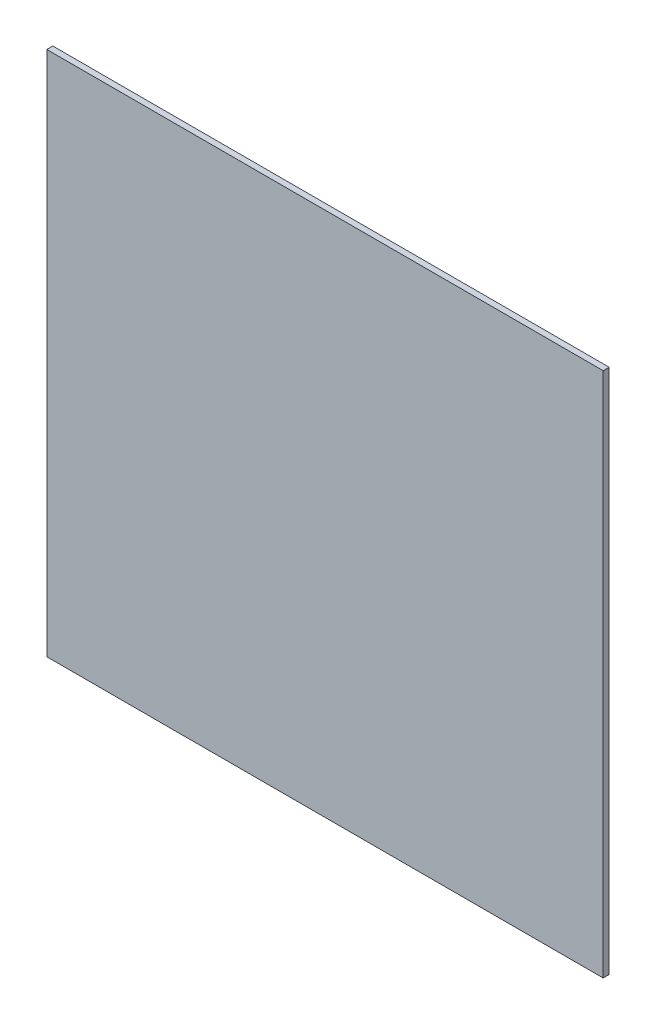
ISO-10303-21;
HEADER;
FILE_DESCRIPTION(('STEP AP214'),'2;1');
FILE_NAME('part.step','',(''),(''),'','','');
FILE_SCHEMA(('AUTOMOTIVE_DESIGN { 1 0 10303 214 1 1 1 1 }'));
ENDSEC;
DATA;
#1=APPLICATION_CONTEXT('core data for automotive mechanical design processes');
#2=APPLICATION_PROTOCOL_DEFINITION('international standard','automotive_design',2000,#1);
#3=PRODUCT_CONTEXT('',#1,'mechanical');
#4=PRODUCT('Part','Part','',(#3));
#5=PRODUCT_RELATED_PRODUCT_CATEGORY('part','',(#4));
#6=PRODUCT_DEFINITION_FORMATION('','',#4);
#7=PRODUCT_DEFINITION_CONTEXT('part definition',#1,'design');
#8=PRODUCT_DEFINITION('design','',#6,#7);
#9=PRODUCT_DEFINITION_SHAPE('','',#8);
#10=(LENGTH_UNIT() NAMED_UNIT(*) SI_UNIT(.MILLI.,.METRE.));
#11=(NAMED_UNIT(*) PLANE_ANGLE_UNIT() SI_UNIT($,.RADIAN.));
#12=(NAMED_UNIT(*) SI_UNIT($,.STERADIAN.) SOLID_ANGLE_UNIT());
#13=UNCERTAINTY_MEASURE_WITH_UNIT(LENGTH_MEASURE(1.E-05),#10,'distance_accuracy_value','');
#14=(GEOMETRIC_REPRESENTATION_CONTEXT(3) GLOBAL_UNCERTAINTY_ASSIGNED_CONTEXT((#13)) GLOBAL_UNIT_ASSIGNED_CONTEXT((#10,
#11,#12)) REPRESENTATION_CONTEXT('',''));
#15=CARTESIAN_POINT('',(0.,0.,0.));
#16=DIRECTION('',(0.,0.,1.));
#17=DIRECTION('',(1.,0.,0.));
#18=AXIS2_PLACEMENT_3D('',#15,#16,#17);
#19=CARTESIAN_POINT('',(-1515.5,1965.,8.));
#20=DIRECTION('',(1.,0.,0.));
#21=DIRECTION('',(0.,1.,0.));
#22=AXIS2_PLACEMENT_3D('',#19,#20,#21);
#23=PLANE('',#22);
#24=DIRECTION('',(0.,-1.,0.));
#25=VECTOR('',#24,1.);
#26=CARTESIAN_POINT('',(-1515.5,1965.,-8.));
#27=LINE('',#26,#25);
#28=CARTESIAN_POINT('',(-1515.5,1965.,-8.));
#29=VERTEX_POINT('',#28);
#30=CARTESIAN_POINT('',(-1515.5,565.,-8.));
#31=VERTEX_POINT('',#30);
#32=EDGE_CURVE('E93',#29,#31,#27,.T.);
#33=ORIENTED_EDGE('',*,*,#32,.T.);
#34=DIRECTION('',(0.,0.,-1.));
#35=VECTOR('',#34,1.);
#36=CARTESIAN_POINT('',(-1515.5,565.,8.));
#37=LINE('',#36,#35);
#38=CARTESIAN_POINT('',(-1515.5,565.,8.));
#39=VERTEX_POINT('',#38);
#40=EDGE_CURVE('E11',#39,#31,#37,.T.);
#41=ORIENTED_EDGE('',*,*,#40,.F.);
#42=DIRECTION('',(0.,-1.,0.));
#43=VECTOR('',#42,1.);
#44=CARTESIAN_POINT('',(-1515.5,1965.,8.));
#45=LINE('',#44,#43);
#46=CARTESIAN_POINT('',(-1515.5,1965.,8.));
#47=VERTEX_POINT('',#46);
#48=EDGE_CURVE('E81',#47,#39,#45,.T.);
#49=ORIENTED_EDGE('',*,*,#48,.F.);
#50=DIRECTION('',(0.,0.,-1.));
#51=VECTOR('',#50,1.);
#52=CARTESIAN_POINT('',(-1515.5,1965.,8.));
#53=LINE('',#52,#51);
#54=EDGE_CURVE('E89',#47,#29,#53,.T.);
#55=ORIENTED_EDGE('',*,*,#54,.T.);
#56=EDGE_LOOP('',(#33,#41,#49,#55));
#57=FACE_BOUND('',#56,.T.);
#58=ADVANCED_FACE('F30',(#57),#23,.F.);
#59=CARTESIAN_POINT('',(-1515.5,565.,8.));
#60=DIRECTION('',(0.,1.,0.));
#61=DIRECTION('',(0.,0.,1.));
#62=AXIS2_PLACEMENT_3D('',#59,#60,#61);
#63=PLANE('',#62);
#64=DIRECTION('',(1.,0.,0.));
#65=VECTOR('',#64,1.);
#66=CARTESIAN_POINT('',(-1515.5,565.,-8.));
#67=LINE('',#66,#65);
#68=CARTESIAN_POINT('',(-34.4999999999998,565.,-8.));
#69=VERTEX_POINT('',#68);
#70=EDGE_CURVE('E85',#31,#69,#67,.T.);
#71=ORIENTED_EDGE('',*,*,#70,.T.);
#72=DIRECTION('',(0.,0.,-1.));
#73=VECTOR('',#72,1.);
#74=CARTESIAN_POINT('',(-34.4999999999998,565.,8.));
#75=LINE('',#74,#73);
#76=CARTESIAN_POINT('',(-34.4999999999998,565.,8.));
#77=VERTEX_POINT('',#76);
#78=EDGE_CURVE('E38',#77,#69,#75,.T.);
#79=ORIENTED_EDGE('',*,*,#78,.F.);
#80=DIRECTION('',(1.,0.,0.));
#81=VECTOR('',#80,1.);
#82=CARTESIAN_POINT('',(-1515.5,565.,8.));
#83=LINE('',#82,#81);
#84=EDGE_CURVE('E76',#39,#77,#83,.T.);
#85=ORIENTED_EDGE('',*,*,#84,.F.);
#86=ORIENTED_EDGE('',*,*,#40,.T.);
#87=EDGE_LOOP('',(#71,#79,#85,#86));
#88=FACE_BOUND('',#87,.T.);
#89=ADVANCED_FACE('F84',(#88),#63,.F.);
#90=CARTESIAN_POINT('',(-34.5000000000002,1965.,8.));
#91=DIRECTION('',(-1.,0.,0.));
#92=DIRECTION('',(0.,-1.,0.));
#93=AXIS2_PLACEMENT_3D('',#90,#91,#92);
#94=PLANE('',#93);
#95=DIRECTION('',(0.,1.,0.));
#96=VECTOR('',#95,1.);
#97=CARTESIAN_POINT('',(-34.5000000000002,1965.,-8.));
#98=LINE('',#97,#96);
#99=CARTESIAN_POINT('',(-34.5000000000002,1965.,-8.));
#100=VERTEX_POINT('',#99);
#101=EDGE_CURVE('E63',#69,#100,#98,.T.);
#102=ORIENTED_EDGE('',*,*,#101,.T.);
#103=DIRECTION('',(0.,0.,-1.));
#104=VECTOR('',#103,1.);
#105=CARTESIAN_POINT('',(-34.5000000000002,1965.,8.));
#106=LINE('',#105,#104);
#107=CARTESIAN_POINT('',(-34.5000000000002,1965.,8.));
#108=VERTEX_POINT('',#107);
#109=EDGE_CURVE('E86',#108,#100,#106,.T.);
#110=ORIENTED_EDGE('',*,*,#109,.F.);
#111=DIRECTION('',(0.,1.,0.));
#112=VECTOR('',#111,1.);
#113=CARTESIAN_POINT('',(-34.5000000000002,1965.,8.));
#114=LINE('',#113,#112);
#115=EDGE_CURVE('E79',#77,#108,#114,.T.);
#116=ORIENTED_EDGE('',*,*,#115,.F.);
#117=ORIENTED_EDGE('',*,*,#78,.T.);
#118=EDGE_LOOP('',(#102,#110,#116,#117));
#119=FACE_BOUND('',#118,.T.);
#120=ADVANCED_FACE('F87',(#119),#94,.F.);
#121=CARTESIAN_POINT('',(-1515.5,1965.,8.));
#122=DIRECTION('',(0.,-1.,0.));
#123=DIRECTION('',(0.,0.,-1.));
#124=AXIS2_PLACEMENT_3D('',#121,#122,#123);
#125=PLANE('',#124);
#126=DIRECTION('',(-1.,0.,0.));
#127=VECTOR('',#126,1.);
#128=CARTESIAN_POINT('',(-1515.5,1965.,-8.));
#129=LINE('',#128,#127);
#130=EDGE_CURVE('E69',#100,#29,#129,.T.);
#131=ORIENTED_EDGE('',*,*,#130,.T.);
#132=ORIENTED_EDGE('',*,*,#54,.F.);
#133=DIRECTION('',(-1.,0.,0.));
#134=VECTOR('',#133,1.);
#135=CARTESIAN_POINT('',(-1515.5,1965.,8.));
#136=LINE('',#135,#134);
#137=EDGE_CURVE('E46',#108,#47,#136,.T.);
#138=ORIENTED_EDGE('',*,*,#137,.F.);
#139=ORIENTED_EDGE('',*,*,#109,.T.);
#140=EDGE_LOOP('',(#131,#132,#138,#139));
#141=FACE_BOUND('',#140,.T.);
#142=ADVANCED_FACE('F100',(#141),#125,.F.);
#143=CARTESIAN_POINT('',(-1515.5,565.,8.));
#144=DIRECTION('',(0.,0.,1.));
#145=DIRECTION('',(1.,0.,0.));
#146=AXIS2_PLACEMENT_3D('',#143,#144,#145);
#147=PLANE('',#146);
#148=ORIENTED_EDGE('',*,*,#48,.T.);
#149=ORIENTED_EDGE('',*,*,#84,.T.);
#150=ORIENTED_EDGE('',*,*,#115,.T.);
#151=ORIENTED_EDGE('',*,*,#137,.T.);
#152=EDGE_LOOP('',(#148,#149,#150,#151));
#153=FACE_BOUND('',#152,.T.);
#154=ADVANCED_FACE('F77',(#153),#147,.T.);
#155=CARTESIAN_POINT('',(-1515.5,565.,-8.));
#156=DIRECTION('',(0.,0.,1.));
#157=DIRECTION('',(1.,0.,0.));
#158=AXIS2_PLACEMENT_3D('',#155,#156,#157);
#159=PLANE('',#158);
#160=ORIENTED_EDGE('',*,*,#32,.F.);
#161=ORIENTED_EDGE('',*,*,#130,.F.);
#162=ORIENTED_EDGE('',*,*,#101,.F.);
#163=ORIENTED_EDGE('',*,*,#70,.F.);
#164=EDGE_LOOP('',(#160,#161,#162,#163));
#165=FACE_BOUND('',#164,.T.);
#166=ADVANCED_FACE('F103',(#165),#159,.F.);
#167=CLOSED_SHELL('',(#58,#89,#120,#142,#154,#166));
#168=MANIFOLD_SOLID_BREP('B2',#167);
#169=ADVANCED_BREP_SHAPE_REPRESENTATION('',(#18,#168),#14);
#170=SHAPE_DEFINITION_REPRESENTATION(#9,#169);
ENDSEC;
END-ISO-10303-21;
